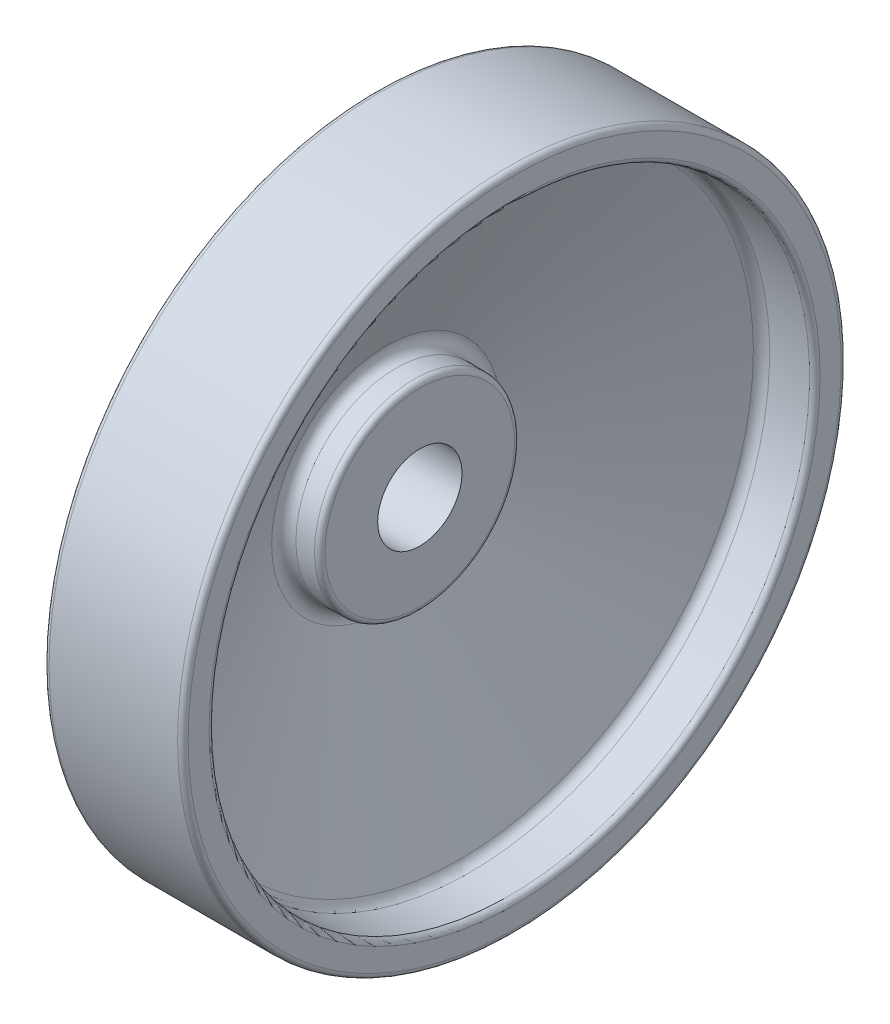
ISO-10303-21;
HEADER;
FILE_DESCRIPTION(('STEP AP214'),'2;1');
FILE_NAME('part.step','',(''),(''),'','','');
FILE_SCHEMA(('AUTOMOTIVE_DESIGN { 1 0 10303 214 1 1 1 1 }'));
ENDSEC;
DATA;
#1=APPLICATION_CONTEXT('core data for automotive mechanical design processes');
#2=APPLICATION_PROTOCOL_DEFINITION('international standard','automotive_design',2000,#1);
#3=PRODUCT_CONTEXT('',#1,'mechanical');
#4=PRODUCT('Part','Part','',(#3));
#5=PRODUCT_RELATED_PRODUCT_CATEGORY('part','',(#4));
#6=PRODUCT_DEFINITION_FORMATION('','',#4);
#7=PRODUCT_DEFINITION_CONTEXT('part definition',#1,'design');
#8=PRODUCT_DEFINITION('design','',#6,#7);
#9=PRODUCT_DEFINITION_SHAPE('','',#8);
#10=(LENGTH_UNIT() NAMED_UNIT(*) SI_UNIT(.MILLI.,.METRE.));
#11=(NAMED_UNIT(*) PLANE_ANGLE_UNIT() SI_UNIT($,.RADIAN.));
#12=(NAMED_UNIT(*) SI_UNIT($,.STERADIAN.) SOLID_ANGLE_UNIT());
#13=UNCERTAINTY_MEASURE_WITH_UNIT(LENGTH_MEASURE(1.E-05),#10,'distance_accuracy_value','');
#14=(GEOMETRIC_REPRESENTATION_CONTEXT(3) GLOBAL_UNCERTAINTY_ASSIGNED_CONTEXT((#13)) GLOBAL_UNIT_ASSIGNED_CONTEXT((#10,
#11,#12)) REPRESENTATION_CONTEXT('',''));
#15=CARTESIAN_POINT('',(0.,0.,0.));
#16=DIRECTION('',(0.,0.,1.));
#17=DIRECTION('',(1.,0.,0.));
#18=AXIS2_PLACEMENT_3D('',#15,#16,#17);
#19=CARTESIAN_POINT('',(-10.,0.,0.));
#20=DIRECTION('',(-1.,0.,0.));
#21=DIRECTION('',(0.,0.,1.));
#22=AXIS2_PLACEMENT_3D('',#19,#20,#21);
#23=CYLINDRICAL_SURFACE('',#22,4.);
#24=CARTESIAN_POINT('',(0.,0.,0.));
#25=DIRECTION('',(-1.,0.,0.));
#26=DIRECTION('',(0.,0.,1.));
#27=AXIS2_PLACEMENT_3D('',#24,#25,#26);
#28=CIRCLE('',#27,4.);
#29=CARTESIAN_POINT('',(0.,0.,4.));
#30=VERTEX_POINT('',#29);
#31=EDGE_CURVE('E8',#30,#30,#28,.T.);
#32=ORIENTED_EDGE('',*,*,#31,.T.);
#33=EDGE_LOOP('',(#32));
#34=FACE_BOUND('',#33,.T.);
#35=CARTESIAN_POINT('',(11.,0.,0.));
#36=DIRECTION('',(-1.,0.,0.));
#37=DIRECTION('',(0.,0.,1.));
#38=AXIS2_PLACEMENT_3D('',#35,#36,#37);
#39=CIRCLE('',#38,4.);
#40=CARTESIAN_POINT('',(11.,0.,4.));
#41=VERTEX_POINT('',#40);
#42=EDGE_CURVE('E82',#41,#41,#39,.T.);
#43=ORIENTED_EDGE('',*,*,#42,.F.);
#44=EDGE_LOOP('',(#43));
#45=FACE_BOUND('',#44,.T.);
#46=ADVANCED_FACE('F12',(#34,#45),#23,.F.);
#47=CARTESIAN_POINT('',(0.,0.,6.5));
#48=DIRECTION('',(-1.,0.,0.));
#49=DIRECTION('',(0.,0.,1.));
#50=AXIS2_PLACEMENT_3D('',#47,#48,#49);
#51=PLANE('',#50);
#52=CARTESIAN_POINT('',(0.,0.,0.));
#53=DIRECTION('',(-1.,0.,0.));
#54=DIRECTION('',(0.,0.,1.));
#55=AXIS2_PLACEMENT_3D('',#52,#53,#54);
#56=CIRCLE('',#55,9.);
#57=CARTESIAN_POINT('',(0.,0.,9.));
#58=VERTEX_POINT('',#57);
#59=EDGE_CURVE('E18',#58,#58,#56,.T.);
#60=ORIENTED_EDGE('',*,*,#59,.T.);
#61=EDGE_LOOP('',(#60));
#62=FACE_BOUND('',#61,.T.);
#63=ORIENTED_EDGE('',*,*,#31,.F.);
#64=EDGE_LOOP('',(#63));
#65=FACE_BOUND('',#64,.T.);
#66=ADVANCED_FACE('F90',(#62,#65),#51,.T.);
#67=CARTESIAN_POINT('',(0.499999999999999,0.,0.));
#68=DIRECTION('',(-1.,0.,0.));
#69=DIRECTION('',(0.,0.,1.));
#70=AXIS2_PLACEMENT_3D('',#67,#68,#69);
#71=TOROIDAL_SURFACE('',#70,9.,0.5);
#72=CARTESIAN_POINT('',(0.499999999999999,0.,0.));
#73=DIRECTION('',(-1.,0.,0.));
#74=DIRECTION('',(0.,0.,1.));
#75=AXIS2_PLACEMENT_3D('',#72,#73,#74);
#76=CIRCLE('',#75,9.5);
#77=CARTESIAN_POINT('',(0.499999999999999,0.,9.5));
#78=VERTEX_POINT('',#77);
#79=EDGE_CURVE('E22',#78,#78,#76,.T.);
#80=ORIENTED_EDGE('',*,*,#79,.T.);
#81=EDGE_LOOP('',(#80));
#82=FACE_BOUND('',#81,.T.);
#83=ORIENTED_EDGE('',*,*,#59,.F.);
#84=EDGE_LOOP('',(#83));
#85=FACE_BOUND('',#84,.T.);
#86=ADVANCED_FACE('F95',(#82,#85),#71,.T.);
#87=CARTESIAN_POINT('',(-10.,0.,0.));
#88=DIRECTION('',(-1.,0.,0.));
#89=DIRECTION('',(0.,0.,1.));
#90=AXIS2_PLACEMENT_3D('',#87,#88,#89);
#91=CYLINDRICAL_SURFACE('',#90,9.5);
#92=CARTESIAN_POINT('',(3.32953979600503,0.,0.));
#93=DIRECTION('',(-1.,0.,0.));
#94=DIRECTION('',(0.,0.,1.));
#95=AXIS2_PLACEMENT_3D('',#92,#93,#94);
#96=CIRCLE('',#95,9.5);
#97=CARTESIAN_POINT('',(3.32953979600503,0.,9.5));
#98=VERTEX_POINT('',#97);
#99=EDGE_CURVE('E26',#98,#98,#96,.T.);
#100=ORIENTED_EDGE('',*,*,#99,.T.);
#101=EDGE_LOOP('',(#100));
#102=FACE_BOUND('',#101,.T.);
#103=ORIENTED_EDGE('',*,*,#79,.F.);
#104=EDGE_LOOP('',(#103));
#105=FACE_BOUND('',#104,.T.);
#106=ADVANCED_FACE('F99',(#102,#105),#91,.T.);
#107=CARTESIAN_POINT('',(3.32953979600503,0.,0.));
#108=DIRECTION('',(-1.,0.,0.));
#109=DIRECTION('',(0.,0.,1.));
#110=AXIS2_PLACEMENT_3D('',#107,#108,#109);
#111=TOROIDAL_SURFACE('',#110,10.5,1.);
#112=CARTESIAN_POINT('',(4.25462071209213,0.,0.));
#113=DIRECTION('',(-1.,0.,0.));
#114=DIRECTION('',(0.,0.,1.));
#115=AXIS2_PLACEMENT_3D('',#112,#113,#114);
#116=CIRCLE('',#115,10.1202299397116);
#117=CARTESIAN_POINT('',(4.25462071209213,0.,10.1202299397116));
#118=VERTEX_POINT('',#117);
#119=EDGE_CURVE('E31',#118,#118,#116,.T.);
#120=ORIENTED_EDGE('',*,*,#119,.T.);
#121=EDGE_LOOP('',(#120));
#122=FACE_BOUND('',#121,.T.);
#123=ORIENTED_EDGE('',*,*,#99,.F.);
#124=EDGE_LOOP('',(#123));
#125=FACE_BOUND('',#124,.T.);
#126=ADVANCED_FACE('F106',(#122,#125),#111,.F.);
#127=CARTESIAN_POINT('',(4.25462071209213,0.,0.));
#128=DIRECTION('',(1.,0.,0.));
#129=DIRECTION('',(0.,0.,-1.));
#130=AXIS2_PLACEMENT_3D('',#127,#128,#129);
#131=CONICAL_SURFACE('',#130,10.1202299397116,1.18124860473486);
#132=CARTESIAN_POINT('',(11.2335680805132,0.,0.));
#133=DIRECTION('',(-1.,0.,0.));
#134=DIRECTION('',(0.,0.,1.));
#135=AXIS2_PLACEMENT_3D('',#132,#133,#134);
#136=CIRCLE('',#135,27.1202299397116);
#137=CARTESIAN_POINT('',(11.2335680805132,0.,27.1202299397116));
#138=VERTEX_POINT('',#137);
#139=EDGE_CURVE('E34',#138,#138,#136,.T.);
#140=ORIENTED_EDGE('',*,*,#139,.T.);
#141=EDGE_LOOP('',(#140));
#142=FACE_BOUND('',#141,.T.);
#143=ORIENTED_EDGE('',*,*,#119,.F.);
#144=EDGE_LOOP('',(#143));
#145=FACE_BOUND('',#144,.T.);
#146=ADVANCED_FACE('F110',(#142,#145),#131,.T.);
#147=CARTESIAN_POINT('',(10.3084871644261,0.,0.));
#148=DIRECTION('',(-1.,0.,0.));
#149=DIRECTION('',(0.,0.,1.));
#150=AXIS2_PLACEMENT_3D('',#147,#148,#149);
#151=TOROIDAL_SURFACE('',#150,27.5,1.);
#152=CARTESIAN_POINT('',(10.3084871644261,0.,0.));
#153=DIRECTION('',(-1.,0.,0.));
#154=DIRECTION('',(0.,0.,1.));
#155=AXIS2_PLACEMENT_3D('',#152,#153,#154);
#156=CIRCLE('',#155,28.5);
#157=CARTESIAN_POINT('',(10.3084871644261,0.,28.5));
#158=VERTEX_POINT('',#157);
#159=EDGE_CURVE('E37',#158,#158,#156,.T.);
#160=ORIENTED_EDGE('',*,*,#159,.T.);
#161=EDGE_LOOP('',(#160));
#162=FACE_BOUND('',#161,.T.);
#163=ORIENTED_EDGE('',*,*,#139,.F.);
#164=EDGE_LOOP('',(#163));
#165=FACE_BOUND('',#164,.T.);
#166=ADVANCED_FACE('F114',(#162,#165),#151,.F.);
#167=CARTESIAN_POINT('',(-10.,0.,0.));
#168=DIRECTION('',(-1.,0.,0.));
#169=DIRECTION('',(0.,0.,1.));
#170=AXIS2_PLACEMENT_3D('',#167,#168,#169);
#171=CYLINDRICAL_SURFACE('',#170,28.5);
#172=CARTESIAN_POINT('',(7.3,0.,0.));
#173=DIRECTION('',(-1.,0.,0.));
#174=DIRECTION('',(0.,0.,1.));
#175=AXIS2_PLACEMENT_3D('',#172,#173,#174);
#176=CIRCLE('',#175,28.5);
#177=CARTESIAN_POINT('',(7.3,0.,28.5));
#178=VERTEX_POINT('',#177);
#179=EDGE_CURVE('E40',#178,#178,#176,.T.);
#180=ORIENTED_EDGE('',*,*,#179,.T.);
#181=EDGE_LOOP('',(#180));
#182=FACE_BOUND('',#181,.T.);
#183=ORIENTED_EDGE('',*,*,#159,.F.);
#184=EDGE_LOOP('',(#183));
#185=FACE_BOUND('',#184,.T.);
#186=ADVANCED_FACE('F118',(#182,#185),#171,.F.);
#187=CARTESIAN_POINT('',(7.3,0.,0.));
#188=DIRECTION('',(-1.,0.,0.));
#189=DIRECTION('',(0.,0.,1.));
#190=AXIS2_PLACEMENT_3D('',#187,#188,#189);
#191=TOROIDAL_SURFACE('',#190,29.,0.5);
#192=CARTESIAN_POINT('',(6.8,0.,0.));
#193=DIRECTION('',(-1.,0.,0.));
#194=DIRECTION('',(0.,0.,1.));
#195=AXIS2_PLACEMENT_3D('',#192,#193,#194);
#196=CIRCLE('',#195,29.);
#197=CARTESIAN_POINT('',(6.8,0.,29.));
#198=VERTEX_POINT('',#197);
#199=EDGE_CURVE('E43',#198,#198,#196,.T.);
#200=ORIENTED_EDGE('',*,*,#199,.T.);
#201=EDGE_LOOP('',(#200));
#202=FACE_BOUND('',#201,.T.);
#203=ORIENTED_EDGE('',*,*,#179,.F.);
#204=EDGE_LOOP('',(#203));
#205=FACE_BOUND('',#204,.T.);
#206=ADVANCED_FACE('F122',(#202,#205),#191,.T.);
#207=CARTESIAN_POINT('',(6.8,0.,30.));
#208=DIRECTION('',(-1.,0.,0.));
#209=DIRECTION('',(0.,0.,1.));
#210=AXIS2_PLACEMENT_3D('',#207,#208,#209);
#211=PLANE('',#210);
#212=CARTESIAN_POINT('',(6.8,0.,0.));
#213=DIRECTION('',(-1.,0.,0.));
#214=DIRECTION('',(0.,0.,1.));
#215=AXIS2_PLACEMENT_3D('',#212,#213,#214);
#216=CIRCLE('',#215,31.);
#217=CARTESIAN_POINT('',(6.8,0.,31.));
#218=VERTEX_POINT('',#217);
#219=EDGE_CURVE('E46',#218,#218,#216,.T.);
#220=ORIENTED_EDGE('',*,*,#219,.T.);
#221=EDGE_LOOP('',(#220));
#222=FACE_BOUND('',#221,.T.);
#223=ORIENTED_EDGE('',*,*,#199,.F.);
#224=EDGE_LOOP('',(#223));
#225=FACE_BOUND('',#224,.T.);
#226=ADVANCED_FACE('F126',(#222,#225),#211,.T.);
#227=CARTESIAN_POINT('',(7.3,0.,0.));
#228=DIRECTION('',(-1.,0.,0.));
#229=DIRECTION('',(0.,0.,1.));
#230=AXIS2_PLACEMENT_3D('',#227,#228,#229);
#231=TOROIDAL_SURFACE('',#230,31.,0.5);
#232=CARTESIAN_POINT('',(7.3,0.,0.));
#233=DIRECTION('',(-1.,0.,0.));
#234=DIRECTION('',(0.,0.,1.));
#235=AXIS2_PLACEMENT_3D('',#232,#233,#234);
#236=CIRCLE('',#235,31.5);
#237=CARTESIAN_POINT('',(7.3,0.,31.5));
#238=VERTEX_POINT('',#237);
#239=EDGE_CURVE('E49',#238,#238,#236,.T.);
#240=ORIENTED_EDGE('',*,*,#239,.T.);
#241=EDGE_LOOP('',(#240));
#242=FACE_BOUND('',#241,.T.);
#243=ORIENTED_EDGE('',*,*,#219,.F.);
#244=EDGE_LOOP('',(#243));
#245=FACE_BOUND('',#244,.T.);
#246=ADVANCED_FACE('F130',(#242,#245),#231,.T.);
#247=CARTESIAN_POINT('',(-10.,0.,0.));
#248=DIRECTION('',(-1.,0.,0.));
#249=DIRECTION('',(0.,0.,1.));
#250=AXIS2_PLACEMENT_3D('',#247,#248,#249);
#251=CYLINDRICAL_SURFACE('',#250,31.5);
#252=CARTESIAN_POINT('',(19.5,0.,0.));
#253=DIRECTION('',(-1.,0.,0.));
#254=DIRECTION('',(0.,0.,1.));
#255=AXIS2_PLACEMENT_3D('',#252,#253,#254);
#256=CIRCLE('',#255,31.5);
#257=CARTESIAN_POINT('',(19.5,0.,31.5));
#258=VERTEX_POINT('',#257);
#259=EDGE_CURVE('E52',#258,#258,#256,.T.);
#260=ORIENTED_EDGE('',*,*,#259,.T.);
#261=EDGE_LOOP('',(#260));
#262=FACE_BOUND('',#261,.T.);
#263=ORIENTED_EDGE('',*,*,#239,.F.);
#264=EDGE_LOOP('',(#263));
#265=FACE_BOUND('',#264,.T.);
#266=ADVANCED_FACE('F134',(#262,#265),#251,.T.);
#267=CARTESIAN_POINT('',(19.5,0.,0.));
#268=DIRECTION('',(-1.,0.,0.));
#269=DIRECTION('',(0.,0.,1.));
#270=AXIS2_PLACEMENT_3D('',#267,#268,#269);
#271=TOROIDAL_SURFACE('',#270,31.,0.5);
#272=CARTESIAN_POINT('',(20.,0.,0.));
#273=DIRECTION('',(-1.,0.,0.));
#274=DIRECTION('',(0.,0.,1.));
#275=AXIS2_PLACEMENT_3D('',#272,#273,#274);
#276=CIRCLE('',#275,31.);
#277=CARTESIAN_POINT('',(20.,0.,31.));
#278=VERTEX_POINT('',#277);
#279=EDGE_CURVE('E55',#278,#278,#276,.T.);
#280=ORIENTED_EDGE('',*,*,#279,.T.);
#281=EDGE_LOOP('',(#280));
#282=FACE_BOUND('',#281,.T.);
#283=ORIENTED_EDGE('',*,*,#259,.F.);
#284=EDGE_LOOP('',(#283));
#285=FACE_BOUND('',#284,.T.);
#286=ADVANCED_FACE('F138',(#282,#285),#271,.T.);
#287=CARTESIAN_POINT('',(20.,0.,30.));
#288=DIRECTION('',(1.,0.,0.));
#289=DIRECTION('',(0.,0.,-1.));
#290=AXIS2_PLACEMENT_3D('',#287,#288,#289);
#291=PLANE('',#290);
#292=CARTESIAN_POINT('',(20.,0.,0.));
#293=DIRECTION('',(-1.,0.,0.));
#294=DIRECTION('',(0.,0.,1.));
#295=AXIS2_PLACEMENT_3D('',#292,#293,#294);
#296=CIRCLE('',#295,29.);
#297=CARTESIAN_POINT('',(20.,0.,29.));
#298=VERTEX_POINT('',#297);
#299=EDGE_CURVE('E58',#298,#298,#296,.T.);
#300=ORIENTED_EDGE('',*,*,#299,.T.);
#301=EDGE_LOOP('',(#300));
#302=FACE_BOUND('',#301,.T.);
#303=ORIENTED_EDGE('',*,*,#279,.F.);
#304=EDGE_LOOP('',(#303));
#305=FACE_BOUND('',#304,.T.);
#306=ADVANCED_FACE('F142',(#302,#305),#291,.T.);
#307=CARTESIAN_POINT('',(19.5,0.,0.));
#308=DIRECTION('',(-1.,0.,0.));
#309=DIRECTION('',(0.,0.,1.));
#310=AXIS2_PLACEMENT_3D('',#307,#308,#309);
#311=TOROIDAL_SURFACE('',#310,29.,0.5);
#312=CARTESIAN_POINT('',(19.5,0.,0.));
#313=DIRECTION('',(-1.,0.,0.));
#314=DIRECTION('',(0.,0.,1.));
#315=AXIS2_PLACEMENT_3D('',#312,#313,#314);
#316=CIRCLE('',#315,28.5);
#317=CARTESIAN_POINT('',(19.5,0.,28.5));
#318=VERTEX_POINT('',#317);
#319=EDGE_CURVE('E61',#318,#318,#316,.T.);
#320=ORIENTED_EDGE('',*,*,#319,.T.);
#321=EDGE_LOOP('',(#320));
#322=FACE_BOUND('',#321,.T.);
#323=ORIENTED_EDGE('',*,*,#299,.F.);
#324=EDGE_LOOP('',(#323));
#325=FACE_BOUND('',#324,.T.);
#326=ADVANCED_FACE('F146',(#322,#325),#311,.T.);
#327=CARTESIAN_POINT('',(-10.,0.,0.));
#328=DIRECTION('',(-1.,0.,0.));
#329=DIRECTION('',(0.,0.,1.));
#330=AXIS2_PLACEMENT_3D('',#327,#328,#329);
#331=CYLINDRICAL_SURFACE('',#330,28.5);
#332=CARTESIAN_POINT('',(15.713419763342,0.,0.));
#333=DIRECTION('',(-1.,0.,0.));
#334=DIRECTION('',(0.,0.,1.));
#335=AXIS2_PLACEMENT_3D('',#332,#333,#334);
#336=CIRCLE('',#335,28.5);
#337=CARTESIAN_POINT('',(15.713419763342,0.,28.5));
#338=VERTEX_POINT('',#337);
#339=EDGE_CURVE('E64',#338,#338,#336,.T.);
#340=ORIENTED_EDGE('',*,*,#339,.T.);
#341=EDGE_LOOP('',(#340));
#342=FACE_BOUND('',#341,.T.);
#343=ORIENTED_EDGE('',*,*,#319,.F.);
#344=EDGE_LOOP('',(#343));
#345=FACE_BOUND('',#344,.T.);
#346=ADVANCED_FACE('F150',(#342,#345),#331,.F.);
#347=CARTESIAN_POINT('',(15.713419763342,0.,0.));
#348=DIRECTION('',(-1.,0.,0.));
#349=DIRECTION('',(0.,0.,1.));
#350=AXIS2_PLACEMENT_3D('',#347,#348,#349);
#351=TOROIDAL_SURFACE('',#350,27.5,1.);
#352=CARTESIAN_POINT('',(14.7883388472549,0.,0.));
#353=DIRECTION('',(-1.,0.,0.));
#354=DIRECTION('',(0.,0.,1.));
#355=AXIS2_PLACEMENT_3D('',#352,#353,#354);
#356=CIRCLE('',#355,27.8797700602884);
#357=CARTESIAN_POINT('',(14.7883388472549,0.,27.8797700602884));
#358=VERTEX_POINT('',#357);
#359=EDGE_CURVE('E67',#358,#358,#356,.T.);
#360=ORIENTED_EDGE('',*,*,#359,.T.);
#361=EDGE_LOOP('',(#360));
#362=FACE_BOUND('',#361,.T.);
#363=ORIENTED_EDGE('',*,*,#339,.F.);
#364=EDGE_LOOP('',(#363));
#365=FACE_BOUND('',#364,.T.);
#366=ADVANCED_FACE('F154',(#362,#365),#351,.F.);
#367=CARTESIAN_POINT('',(14.7883388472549,0.,0.));
#368=DIRECTION('',(1.,0.,0.));
#369=DIRECTION('',(0.,0.,-1.));
#370=AXIS2_PLACEMENT_3D('',#367,#368,#369);
#371=CONICAL_SURFACE('',#370,27.8797700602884,1.18124860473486);
#372=CARTESIAN_POINT('',(7.80939147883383,0.,0.));
#373=DIRECTION('',(-1.,0.,0.));
#374=DIRECTION('',(0.,0.,1.));
#375=AXIS2_PLACEMENT_3D('',#372,#373,#374);
#376=CIRCLE('',#375,10.8797700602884);
#377=CARTESIAN_POINT('',(7.80939147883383,0.,10.8797700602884));
#378=VERTEX_POINT('',#377);
#379=EDGE_CURVE('E70',#378,#378,#376,.T.);
#380=ORIENTED_EDGE('',*,*,#379,.T.);
#381=EDGE_LOOP('',(#380));
#382=FACE_BOUND('',#381,.T.);
#383=ORIENTED_EDGE('',*,*,#359,.F.);
#384=EDGE_LOOP('',(#383));
#385=FACE_BOUND('',#384,.T.);
#386=ADVANCED_FACE('F158',(#382,#385),#371,.F.);
#387=CARTESIAN_POINT('',(8.73447239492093,0.,0.));
#388=DIRECTION('',(-1.,0.,0.));
#389=DIRECTION('',(0.,0.,1.));
#390=AXIS2_PLACEMENT_3D('',#387,#388,#389);
#391=TOROIDAL_SURFACE('',#390,10.5,1.);
#392=CARTESIAN_POINT('',(8.73447239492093,0.,0.));
#393=DIRECTION('',(-1.,0.,0.));
#394=DIRECTION('',(0.,0.,1.));
#395=AXIS2_PLACEMENT_3D('',#392,#393,#394);
#396=CIRCLE('',#395,9.5);
#397=CARTESIAN_POINT('',(8.73447239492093,0.,9.5));
#398=VERTEX_POINT('',#397);
#399=EDGE_CURVE('E73',#398,#398,#396,.T.);
#400=ORIENTED_EDGE('',*,*,#399,.T.);
#401=EDGE_LOOP('',(#400));
#402=FACE_BOUND('',#401,.T.);
#403=ORIENTED_EDGE('',*,*,#379,.F.);
#404=EDGE_LOOP('',(#403));
#405=FACE_BOUND('',#404,.T.);
#406=ADVANCED_FACE('F162',(#402,#405),#391,.F.);
#407=CARTESIAN_POINT('',(-10.,0.,0.));
#408=DIRECTION('',(-1.,0.,0.));
#409=DIRECTION('',(0.,0.,1.));
#410=AXIS2_PLACEMENT_3D('',#407,#408,#409);
#411=CYLINDRICAL_SURFACE('',#410,9.5);
#412=CARTESIAN_POINT('',(10.5,0.,0.));
#413=DIRECTION('',(-1.,0.,0.));
#414=DIRECTION('',(0.,0.,1.));
#415=AXIS2_PLACEMENT_3D('',#412,#413,#414);
#416=CIRCLE('',#415,9.5);
#417=CARTESIAN_POINT('',(10.5,0.,9.5));
#418=VERTEX_POINT('',#417);
#419=EDGE_CURVE('E76',#418,#418,#416,.T.);
#420=ORIENTED_EDGE('',*,*,#419,.T.);
#421=EDGE_LOOP('',(#420));
#422=FACE_BOUND('',#421,.T.);
#423=ORIENTED_EDGE('',*,*,#399,.F.);
#424=EDGE_LOOP('',(#423));
#425=FACE_BOUND('',#424,.T.);
#426=ADVANCED_FACE('F166',(#422,#425),#411,.T.);
#427=CARTESIAN_POINT('',(10.5,0.,0.));
#428=DIRECTION('',(-1.,0.,0.));
#429=DIRECTION('',(0.,0.,1.));
#430=AXIS2_PLACEMENT_3D('',#427,#428,#429);
#431=TOROIDAL_SURFACE('',#430,9.,0.5);
#432=CARTESIAN_POINT('',(11.,0.,0.));
#433=DIRECTION('',(-1.,0.,0.));
#434=DIRECTION('',(0.,0.,1.));
#435=AXIS2_PLACEMENT_3D('',#432,#433,#434);
#436=CIRCLE('',#435,9.);
#437=CARTESIAN_POINT('',(11.,0.,9.));
#438=VERTEX_POINT('',#437);
#439=EDGE_CURVE('E79',#438,#438,#436,.T.);
#440=ORIENTED_EDGE('',*,*,#439,.T.);
#441=EDGE_LOOP('',(#440));
#442=FACE_BOUND('',#441,.T.);
#443=ORIENTED_EDGE('',*,*,#419,.F.);
#444=EDGE_LOOP('',(#443));
#445=FACE_BOUND('',#444,.T.);
#446=ADVANCED_FACE('F170',(#442,#445),#431,.T.);
#447=CARTESIAN_POINT('',(11.,0.,6.5));
#448=DIRECTION('',(1.,0.,0.));
#449=DIRECTION('',(0.,0.,-1.));
#450=AXIS2_PLACEMENT_3D('',#447,#448,#449);
#451=PLANE('',#450);
#452=ORIENTED_EDGE('',*,*,#42,.T.);
#453=EDGE_LOOP('',(#452));
#454=FACE_BOUND('',#453,.T.);
#455=ORIENTED_EDGE('',*,*,#439,.F.);
#456=EDGE_LOOP('',(#455));
#457=FACE_BOUND('',#456,.T.);
#458=ADVANCED_FACE('F86',(#454,#457),#451,.T.);
#459=CLOSED_SHELL('',(#46,#66,#86,#106,#126,#146,#166,#186,#206,#226,#246,#266,#286,#306,#326,
#346,#366,#386,#406,#426,#446,#458));
#460=MANIFOLD_SOLID_BREP('B1',#459);
#461=ADVANCED_BREP_SHAPE_REPRESENTATION('',(#18,#460),#14);
#462=SHAPE_DEFINITION_REPRESENTATION(#9,#461);
ENDSEC;
END-ISO-10303-21;
